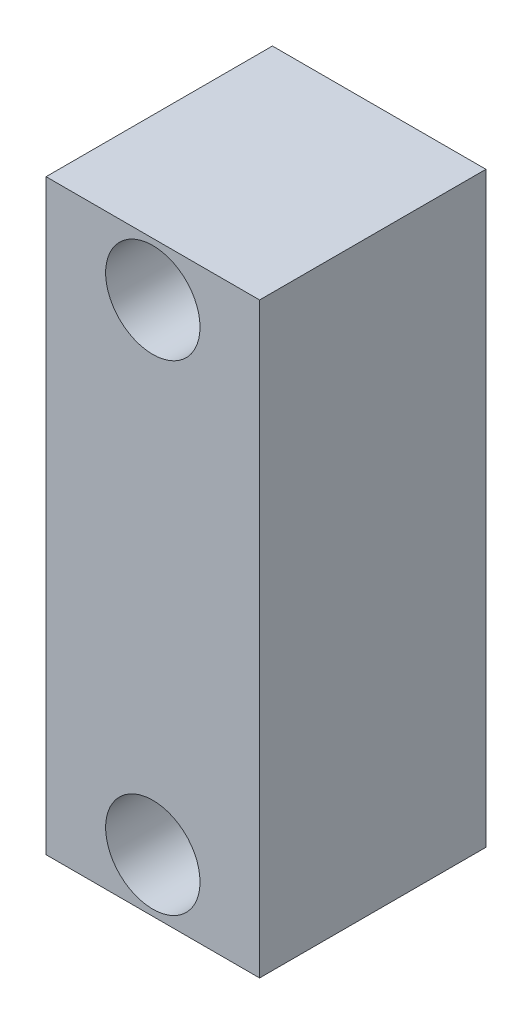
ISO-10303-21;
HEADER;
FILE_DESCRIPTION(('STEP AP214'),'2;1');
FILE_NAME('part.step','',(''),(''),'','','');
FILE_SCHEMA(('AUTOMOTIVE_DESIGN { 1 0 10303 214 1 1 1 1 }'));
ENDSEC;
DATA;
#1=APPLICATION_CONTEXT('core data for automotive mechanical design processes');
#2=APPLICATION_PROTOCOL_DEFINITION('international standard','automotive_design',2000,#1);
#3=PRODUCT_CONTEXT('',#1,'mechanical');
#4=PRODUCT('Part','Part','',(#3));
#5=PRODUCT_RELATED_PRODUCT_CATEGORY('part','',(#4));
#6=PRODUCT_DEFINITION_FORMATION('','',#4);
#7=PRODUCT_DEFINITION_CONTEXT('part definition',#1,'design');
#8=PRODUCT_DEFINITION('design','',#6,#7);
#9=PRODUCT_DEFINITION_SHAPE('','',#8);
#10=(LENGTH_UNIT() NAMED_UNIT(*) SI_UNIT(.MILLI.,.METRE.));
#11=(NAMED_UNIT(*) PLANE_ANGLE_UNIT() SI_UNIT($,.RADIAN.));
#12=(NAMED_UNIT(*) SI_UNIT($,.STERADIAN.) SOLID_ANGLE_UNIT());
#13=UNCERTAINTY_MEASURE_WITH_UNIT(LENGTH_MEASURE(1.E-05),#10,'distance_accuracy_value','');
#14=(GEOMETRIC_REPRESENTATION_CONTEXT(3) GLOBAL_UNCERTAINTY_ASSIGNED_CONTEXT((#13)) GLOBAL_UNIT_ASSIGNED_CONTEXT((#10,
#11,#12)) REPRESENTATION_CONTEXT('',''));
#15=CARTESIAN_POINT('',(0.,0.,0.));
#16=DIRECTION('',(0.,0.,1.));
#17=DIRECTION('',(1.,0.,0.));
#18=AXIS2_PLACEMENT_3D('',#15,#16,#17);
#19=CARTESIAN_POINT('',(-12.7,34.925,13.462));
#20=DIRECTION('',(1.,0.,0.));
#21=DIRECTION('',(0.,1.,0.));
#22=AXIS2_PLACEMENT_3D('',#19,#20,#21);
#23=PLANE('',#22);
#24=DIRECTION('',(0.,-1.,0.));
#25=VECTOR('',#24,1.);
#26=CARTESIAN_POINT('',(-12.7,34.925,-13.462));
#27=LINE('',#26,#25);
#28=CARTESIAN_POINT('',(-12.7,34.925,-13.462));
#29=VERTEX_POINT('',#28);
#30=CARTESIAN_POINT('',(-12.7,-34.925,-13.462));
#31=VERTEX_POINT('',#30);
#32=EDGE_CURVE('E96',#29,#31,#27,.T.);
#33=ORIENTED_EDGE('',*,*,#32,.T.);
#34=DIRECTION('',(0.,0.,-1.));
#35=VECTOR('',#34,1.);
#36=CARTESIAN_POINT('',(-12.7,-34.925,13.462));
#37=LINE('',#36,#35);
#38=CARTESIAN_POINT('',(-12.7,-34.925,13.462));
#39=VERTEX_POINT('',#38);
#40=EDGE_CURVE('E11',#39,#31,#37,.T.);
#41=ORIENTED_EDGE('',*,*,#40,.F.);
#42=DIRECTION('',(0.,-1.,0.));
#43=VECTOR('',#42,1.);
#44=CARTESIAN_POINT('',(-12.7,34.925,13.462));
#45=LINE('',#44,#43);
#46=CARTESIAN_POINT('',(-12.7,34.925,13.462));
#47=VERTEX_POINT('',#46);
#48=EDGE_CURVE('E84',#47,#39,#45,.T.);
#49=ORIENTED_EDGE('',*,*,#48,.F.);
#50=DIRECTION('',(0.,0.,-1.));
#51=VECTOR('',#50,1.);
#52=CARTESIAN_POINT('',(-12.7,34.925,13.462));
#53=LINE('',#52,#51);
#54=EDGE_CURVE('E92',#47,#29,#53,.T.);
#55=ORIENTED_EDGE('',*,*,#54,.T.);
#56=EDGE_LOOP('',(#33,#41,#49,#55));
#57=FACE_BOUND('',#56,.T.);
#58=ADVANCED_FACE('F33',(#57),#23,.F.);
#59=CARTESIAN_POINT('',(-12.7,-34.925,13.462));
#60=DIRECTION('',(0.,1.,0.));
#61=DIRECTION('',(0.,0.,1.));
#62=AXIS2_PLACEMENT_3D('',#59,#60,#61);
#63=PLANE('',#62);
#64=DIRECTION('',(1.,0.,0.));
#65=VECTOR('',#64,1.);
#66=CARTESIAN_POINT('',(-12.7,-34.925,-13.462));
#67=LINE('',#66,#65);
#68=CARTESIAN_POINT('',(12.7,-34.925,-13.462));
#69=VERTEX_POINT('',#68);
#70=EDGE_CURVE('E88',#31,#69,#67,.T.);
#71=ORIENTED_EDGE('',*,*,#70,.T.);
#72=DIRECTION('',(0.,0.,-1.));
#73=VECTOR('',#72,1.);
#74=CARTESIAN_POINT('',(12.7,-34.925,13.462));
#75=LINE('',#74,#73);
#76=CARTESIAN_POINT('',(12.7,-34.925,13.462));
#77=VERTEX_POINT('',#76);
#78=EDGE_CURVE('E41',#77,#69,#75,.T.);
#79=ORIENTED_EDGE('',*,*,#78,.F.);
#80=DIRECTION('',(1.,0.,0.));
#81=VECTOR('',#80,1.);
#82=CARTESIAN_POINT('',(-12.7,-34.925,13.462));
#83=LINE('',#82,#81);
#84=EDGE_CURVE('E79',#39,#77,#83,.T.);
#85=ORIENTED_EDGE('',*,*,#84,.F.);
#86=ORIENTED_EDGE('',*,*,#40,.T.);
#87=EDGE_LOOP('',(#71,#79,#85,#86));
#88=FACE_BOUND('',#87,.T.);
#89=ADVANCED_FACE('F87',(#88),#63,.F.);
#90=CARTESIAN_POINT('',(12.7,34.925,13.462));
#91=DIRECTION('',(-1.,0.,0.));
#92=DIRECTION('',(0.,-1.,0.));
#93=AXIS2_PLACEMENT_3D('',#90,#91,#92);
#94=PLANE('',#93);
#95=DIRECTION('',(0.,1.,0.));
#96=VECTOR('',#95,1.);
#97=CARTESIAN_POINT('',(12.7,34.925,-13.462));
#98=LINE('',#97,#96);
#99=CARTESIAN_POINT('',(12.7,34.925,-13.462));
#100=VERTEX_POINT('',#99);
#101=EDGE_CURVE('E66',#69,#100,#98,.T.);
#102=ORIENTED_EDGE('',*,*,#101,.T.);
#103=DIRECTION('',(0.,0.,-1.));
#104=VECTOR('',#103,1.);
#105=CARTESIAN_POINT('',(12.7,34.925,13.462));
#106=LINE('',#105,#104);
#107=CARTESIAN_POINT('',(12.7,34.925,13.462));
#108=VERTEX_POINT('',#107);
#109=EDGE_CURVE('E89',#108,#100,#106,.T.);
#110=ORIENTED_EDGE('',*,*,#109,.F.);
#111=DIRECTION('',(0.,1.,0.));
#112=VECTOR('',#111,1.);
#113=CARTESIAN_POINT('',(12.7,34.925,13.462));
#114=LINE('',#113,#112);
#115=EDGE_CURVE('E82',#77,#108,#114,.T.);
#116=ORIENTED_EDGE('',*,*,#115,.F.);
#117=ORIENTED_EDGE('',*,*,#78,.T.);
#118=EDGE_LOOP('',(#102,#110,#116,#117));
#119=FACE_BOUND('',#118,.T.);
#120=ADVANCED_FACE('F90',(#119),#94,.F.);
#121=CARTESIAN_POINT('',(-12.7,34.925,13.462));
#122=DIRECTION('',(0.,-1.,0.));
#123=DIRECTION('',(0.,0.,-1.));
#124=AXIS2_PLACEMENT_3D('',#121,#122,#123);
#125=PLANE('',#124);
#126=DIRECTION('',(-1.,0.,0.));
#127=VECTOR('',#126,1.);
#128=CARTESIAN_POINT('',(-12.7,34.925,-13.462));
#129=LINE('',#128,#127);
#130=EDGE_CURVE('E72',#100,#29,#129,.T.);
#131=ORIENTED_EDGE('',*,*,#130,.T.);
#132=ORIENTED_EDGE('',*,*,#54,.F.);
#133=DIRECTION('',(-1.,0.,0.));
#134=VECTOR('',#133,1.);
#135=CARTESIAN_POINT('',(-12.7,34.925,13.462));
#136=LINE('',#135,#134);
#137=EDGE_CURVE('E49',#108,#47,#136,.T.);
#138=ORIENTED_EDGE('',*,*,#137,.F.);
#139=ORIENTED_EDGE('',*,*,#109,.T.);
#140=EDGE_LOOP('',(#131,#132,#138,#139));
#141=FACE_BOUND('',#140,.T.);
#142=ADVANCED_FACE('F104',(#141),#125,.F.);
#143=CARTESIAN_POINT('',(-12.7,-34.925,13.462));
#144=DIRECTION('',(0.,0.,1.));
#145=DIRECTION('',(1.,0.,0.));
#146=AXIS2_PLACEMENT_3D('',#143,#144,#145);
#147=PLANE('',#146);
#148=CARTESIAN_POINT('',(0.,28.575,13.462));
#149=DIRECTION('',(0.,0.,1.));
#150=DIRECTION('',(1.,0.,0.));
#151=AXIS2_PLACEMENT_3D('',#148,#149,#150);
#152=CIRCLE('',#151,5.6134);
#153=CARTESIAN_POINT('',(5.6134,28.575,13.462));
#154=VERTEX_POINT('',#153);
#155=EDGE_CURVE('E121',#154,#154,#152,.T.);
#156=ORIENTED_EDGE('',*,*,#155,.F.);
#157=EDGE_LOOP('',(#156));
#158=FACE_BOUND('',#157,.T.);
#159=CARTESIAN_POINT('',(0.,-28.575,13.462));
#160=DIRECTION('',(0.,0.,1.));
#161=DIRECTION('',(1.,0.,0.));
#162=AXIS2_PLACEMENT_3D('',#159,#160,#161);
#163=CIRCLE('',#162,5.6134);
#164=CARTESIAN_POINT('',(5.6134,-28.575,13.462));
#165=VERTEX_POINT('',#164);
#166=EDGE_CURVE('E99',#165,#165,#163,.T.);
#167=ORIENTED_EDGE('',*,*,#166,.F.);
#168=EDGE_LOOP('',(#167));
#169=FACE_BOUND('',#168,.T.);
#170=ORIENTED_EDGE('',*,*,#48,.T.);
#171=ORIENTED_EDGE('',*,*,#84,.T.);
#172=ORIENTED_EDGE('',*,*,#115,.T.);
#173=ORIENTED_EDGE('',*,*,#137,.T.);
#174=EDGE_LOOP('',(#170,#171,#172,#173));
#175=FACE_BOUND('',#174,.T.);
#176=ADVANCED_FACE('F80',(#158,#169,#175),#147,.T.);
#177=CARTESIAN_POINT('',(-12.7,-34.925,-13.462));
#178=DIRECTION('',(0.,0.,1.));
#179=DIRECTION('',(1.,0.,0.));
#180=AXIS2_PLACEMENT_3D('',#177,#178,#179);
#181=PLANE('',#180);
#182=CARTESIAN_POINT('',(0.,28.575,-13.462));
#183=DIRECTION('',(0.,0.,1.));
#184=DIRECTION('',(1.,0.,0.));
#185=AXIS2_PLACEMENT_3D('',#182,#183,#184);
#186=CIRCLE('',#185,4.49999999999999);
#187=CARTESIAN_POINT('',(4.49999999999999,28.575,-13.462));
#188=VERTEX_POINT('',#187);
#189=EDGE_CURVE('E130',#188,#188,#186,.T.);
#190=ORIENTED_EDGE('',*,*,#189,.T.);
#191=EDGE_LOOP('',(#190));
#192=FACE_BOUND('',#191,.T.);
#193=CARTESIAN_POINT('',(0.,-28.575,-13.462));
#194=DIRECTION('',(0.,0.,1.));
#195=DIRECTION('',(1.,0.,0.));
#196=AXIS2_PLACEMENT_3D('',#193,#194,#195);
#197=CIRCLE('',#196,4.49999999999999);
#198=CARTESIAN_POINT('',(4.49999999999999,-28.575,-13.462));
#199=VERTEX_POINT('',#198);
#200=EDGE_CURVE('E118',#199,#199,#197,.T.);
#201=ORIENTED_EDGE('',*,*,#200,.T.);
#202=EDGE_LOOP('',(#201));
#203=FACE_BOUND('',#202,.T.);
#204=ORIENTED_EDGE('',*,*,#32,.F.);
#205=ORIENTED_EDGE('',*,*,#130,.F.);
#206=ORIENTED_EDGE('',*,*,#101,.F.);
#207=ORIENTED_EDGE('',*,*,#70,.F.);
#208=EDGE_LOOP('',(#204,#205,#206,#207));
#209=FACE_BOUND('',#208,.T.);
#210=ADVANCED_FACE('F107',(#192,#203,#209),#181,.F.);
#211=CARTESIAN_POINT('',(0.,-28.575,13.462));
#212=DIRECTION('',(0.,0.,1.));
#213=DIRECTION('',(1.,0.,0.));
#214=AXIS2_PLACEMENT_3D('',#211,#212,#213);
#215=CYLINDRICAL_SURFACE('',#214,5.6134);
#216=CARTESIAN_POINT('',(0.,-28.575,5.462));
#217=DIRECTION('',(0.,0.,1.));
#218=DIRECTION('',(1.,0.,0.));
#219=AXIS2_PLACEMENT_3D('',#216,#217,#218);
#220=CIRCLE('',#219,5.6134);
#221=CARTESIAN_POINT('',(5.6134,-28.575,5.462));
#222=VERTEX_POINT('',#221);
#223=EDGE_CURVE('E112',#222,#222,#220,.T.);
#224=ORIENTED_EDGE('',*,*,#223,.F.);
#225=EDGE_LOOP('',(#224));
#226=FACE_BOUND('',#225,.T.);
#227=ORIENTED_EDGE('',*,*,#166,.T.);
#228=EDGE_LOOP('',(#227));
#229=FACE_BOUND('',#228,.T.);
#230=ADVANCED_FACE('F160',(#226,#229),#215,.F.);
#231=CARTESIAN_POINT('',(4.5,-28.575,5.462));
#232=DIRECTION('',(0.,0.,-1.));
#233=DIRECTION('',(-1.,0.,0.));
#234=AXIS2_PLACEMENT_3D('',#231,#232,#233);
#235=PLANE('',#234);
#236=CARTESIAN_POINT('',(0.,-28.575,5.462));
#237=DIRECTION('',(0.,0.,1.));
#238=DIRECTION('',(1.,0.,0.));
#239=AXIS2_PLACEMENT_3D('',#236,#237,#238);
#240=CIRCLE('',#239,4.5);
#241=CARTESIAN_POINT('',(4.5,-28.575,5.462));
#242=VERTEX_POINT('',#241);
#243=EDGE_CURVE('E115',#242,#242,#240,.T.);
#244=ORIENTED_EDGE('',*,*,#243,.F.);
#245=EDGE_LOOP('',(#244));
#246=FACE_BOUND('',#245,.T.);
#247=ORIENTED_EDGE('',*,*,#223,.T.);
#248=EDGE_LOOP('',(#247));
#249=FACE_BOUND('',#248,.T.);
#250=ADVANCED_FACE('F162',(#246,#249),#235,.F.);
#251=CARTESIAN_POINT('',(0.,-28.575,13.462));
#252=DIRECTION('',(0.,0.,1.));
#253=DIRECTION('',(1.,0.,0.));
#254=AXIS2_PLACEMENT_3D('',#251,#252,#253);
#255=CYLINDRICAL_SURFACE('',#254,4.5);
#256=ORIENTED_EDGE('',*,*,#200,.F.);
#257=EDGE_LOOP('',(#256));
#258=FACE_BOUND('',#257,.T.);
#259=ORIENTED_EDGE('',*,*,#243,.T.);
#260=EDGE_LOOP('',(#259));
#261=FACE_BOUND('',#260,.T.);
#262=ADVANCED_FACE('F151',(#258,#261),#255,.F.);
#263=CARTESIAN_POINT('',(0.,28.575,13.462));
#264=DIRECTION('',(0.,0.,1.));
#265=DIRECTION('',(1.,0.,0.));
#266=AXIS2_PLACEMENT_3D('',#263,#264,#265);
#267=CYLINDRICAL_SURFACE('',#266,5.6134);
#268=CARTESIAN_POINT('',(0.,28.575,5.462));
#269=DIRECTION('',(0.,0.,1.));
#270=DIRECTION('',(1.,0.,0.));
#271=AXIS2_PLACEMENT_3D('',#268,#269,#270);
#272=CIRCLE('',#271,5.6134);
#273=CARTESIAN_POINT('',(5.6134,28.575,5.462));
#274=VERTEX_POINT('',#273);
#275=EDGE_CURVE('E124',#274,#274,#272,.T.);
#276=ORIENTED_EDGE('',*,*,#275,.F.);
#277=EDGE_LOOP('',(#276));
#278=FACE_BOUND('',#277,.T.);
#279=ORIENTED_EDGE('',*,*,#155,.T.);
#280=EDGE_LOOP('',(#279));
#281=FACE_BOUND('',#280,.T.);
#282=ADVANCED_FACE('F145',(#278,#281),#267,.F.);
#283=CARTESIAN_POINT('',(4.5,28.575,5.462));
#284=DIRECTION('',(0.,0.,-1.));
#285=DIRECTION('',(-1.,0.,0.));
#286=AXIS2_PLACEMENT_3D('',#283,#284,#285);
#287=PLANE('',#286);
#288=CARTESIAN_POINT('',(0.,28.575,5.462));
#289=DIRECTION('',(0.,0.,1.));
#290=DIRECTION('',(1.,0.,0.));
#291=AXIS2_PLACEMENT_3D('',#288,#289,#290);
#292=CIRCLE('',#291,4.5);
#293=CARTESIAN_POINT('',(4.5,28.575,5.462));
#294=VERTEX_POINT('',#293);
#295=EDGE_CURVE('E127',#294,#294,#292,.T.);
#296=ORIENTED_EDGE('',*,*,#295,.F.);
#297=EDGE_LOOP('',(#296));
#298=FACE_BOUND('',#297,.T.);
#299=ORIENTED_EDGE('',*,*,#275,.T.);
#300=EDGE_LOOP('',(#299));
#301=FACE_BOUND('',#300,.T.);
#302=ADVANCED_FACE('F139',(#298,#301),#287,.F.);
#303=CARTESIAN_POINT('',(0.,28.575,13.462));
#304=DIRECTION('',(0.,0.,1.));
#305=DIRECTION('',(1.,0.,0.));
#306=AXIS2_PLACEMENT_3D('',#303,#304,#305);
#307=CYLINDRICAL_SURFACE('',#306,4.5);
#308=ORIENTED_EDGE('',*,*,#189,.F.);
#309=EDGE_LOOP('',(#308));
#310=FACE_BOUND('',#309,.T.);
#311=ORIENTED_EDGE('',*,*,#295,.T.);
#312=EDGE_LOOP('',(#311));
#313=FACE_BOUND('',#312,.T.);
#314=ADVANCED_FACE('F136',(#310,#313),#307,.F.);
#315=CLOSED_SHELL('',(#58,#89,#120,#142,#176,#210,#230,#250,#262,#282,#302,#314));
#316=MANIFOLD_SOLID_BREP('B2',#315);
#317=ADVANCED_BREP_SHAPE_REPRESENTATION('',(#18,#316),#14);
#318=SHAPE_DEFINITION_REPRESENTATION(#9,#317);
ENDSEC;
END-ISO-10303-21;
